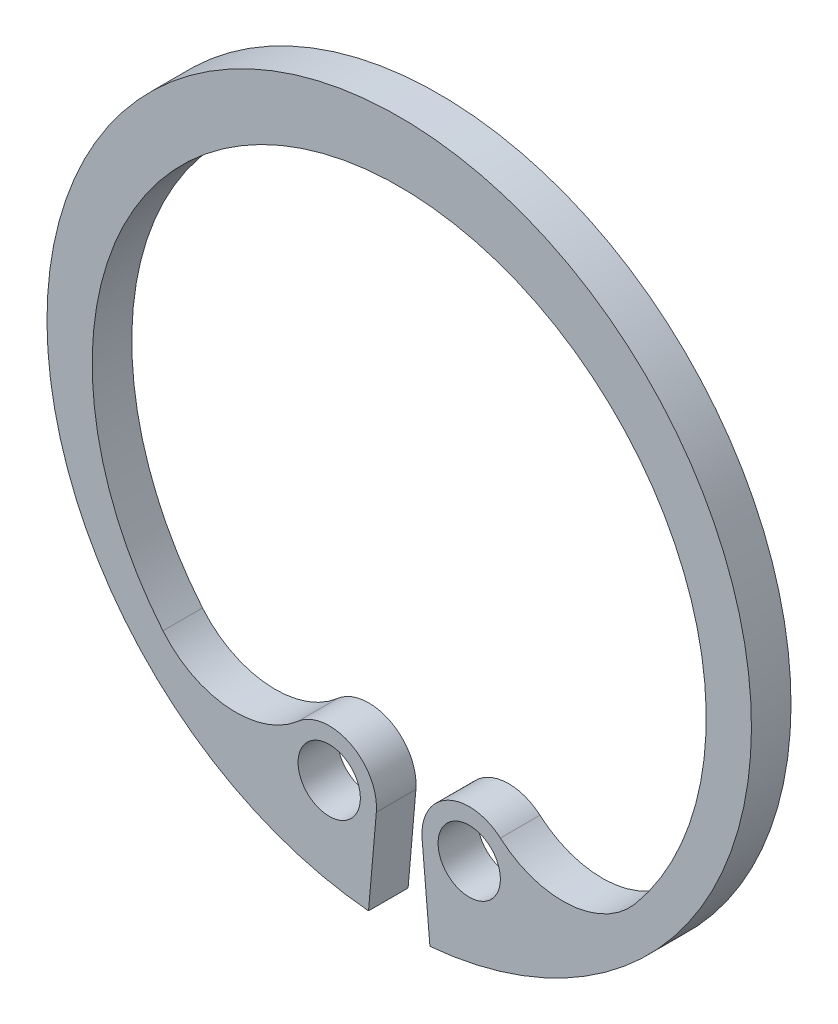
from build123d import *

# Parameters (mm, degrees)
BODYSKE_R  = 0.7874
BODY_DEPTH = 1


with BuildPart() as part:
    # BodySke → Body (new body)
    with BuildSketch(Plane.XY):
        with BuildLine():
            Line((0.77568611, -8.866132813), (0.578328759, -6.610327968))
            ThreePointArc((0.578328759, -6.610327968), (1.228212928, -5.440327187), (2.556179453, -5.606929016))
            ThreePointArc((2.556179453, -5.606929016), (4.320681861, -6.191195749), (5.970292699, -5.334679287))
            ThreePointArc((5.970292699, -5.334679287), (0, 7.376), (-5.970292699, -5.334679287))
            ThreePointArc((-5.970292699, -5.334679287), (-4.320681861, -6.191195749), (-2.556179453, -5.606929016))
            ThreePointArc((-2.556179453, -5.606929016), (-1.228212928, -5.440327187), (-0.578328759, -6.610327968))
            Line((-0.578328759, -6.610327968), (-0.77568611, -8.866132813))
            ThreePointArc((-0.77568611, -8.866132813), (0, 8.9), (0.77568611, -8.866132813))
        make_face()
        with Locations((1.768930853, -6.506163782)):
            Circle(BODYSKE_R, mode=Mode.SUBTRACT)
        with Locations((-1.768930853, -6.506163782)):
            Circle(BODYSKE_R, mode=Mode.SUBTRACT)
    extrude(amount=-BODY_DEPTH)


solid = part.part
